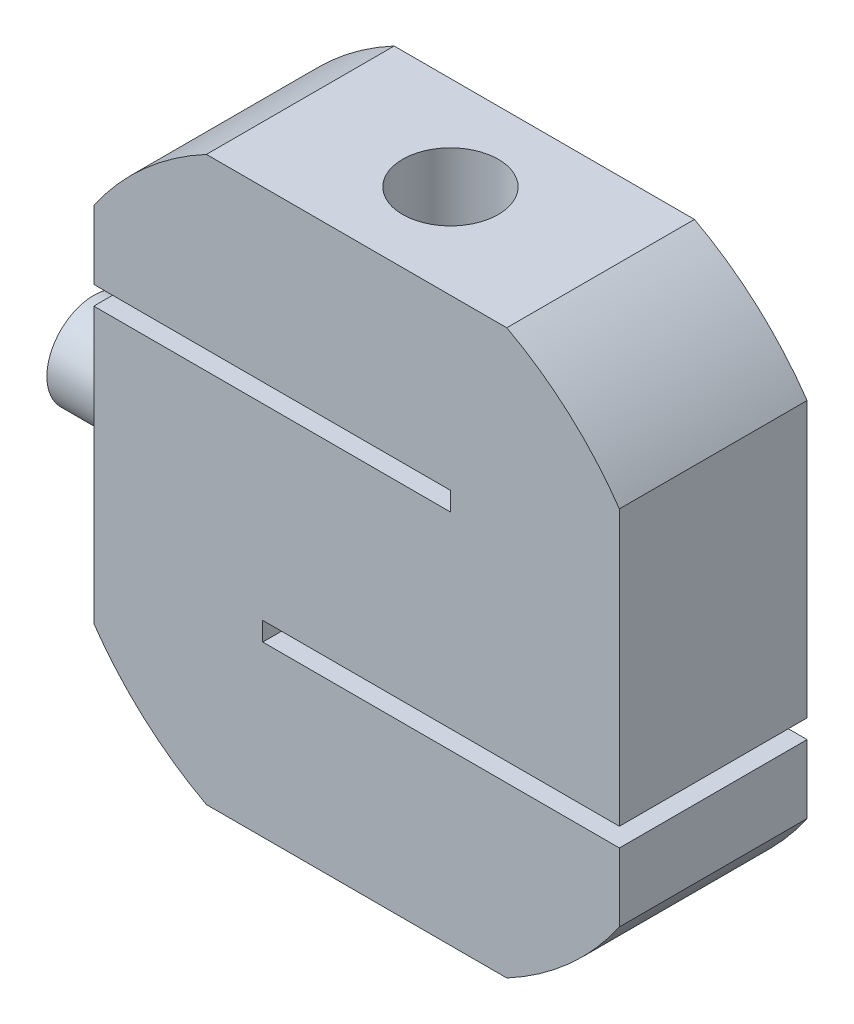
ISO-10303-21;
HEADER;
FILE_DESCRIPTION(('STEP AP214'),'2;1');
FILE_NAME('part.step','',(''),(''),'','','');
FILE_SCHEMA(('AUTOMOTIVE_DESIGN { 1 0 10303 214 1 1 1 1 }'));
ENDSEC;
DATA;
#1=APPLICATION_CONTEXT('core data for automotive mechanical design processes');
#2=APPLICATION_PROTOCOL_DEFINITION('international standard','automotive_design',2000,#1);
#3=PRODUCT_CONTEXT('',#1,'mechanical');
#4=PRODUCT('Part','Part','',(#3));
#5=PRODUCT_RELATED_PRODUCT_CATEGORY('part','',(#4));
#6=PRODUCT_DEFINITION_FORMATION('','',#4);
#7=PRODUCT_DEFINITION_CONTEXT('part definition',#1,'design');
#8=PRODUCT_DEFINITION('design','',#6,#7);
#9=PRODUCT_DEFINITION_SHAPE('','',#8);
#10=(LENGTH_UNIT() NAMED_UNIT(*) SI_UNIT(.MILLI.,.METRE.));
#11=(NAMED_UNIT(*) PLANE_ANGLE_UNIT() SI_UNIT($,.RADIAN.));
#12=(NAMED_UNIT(*) SI_UNIT($,.STERADIAN.) SOLID_ANGLE_UNIT());
#13=UNCERTAINTY_MEASURE_WITH_UNIT(LENGTH_MEASURE(1.E-05),#10,'distance_accuracy_value','');
#14=(GEOMETRIC_REPRESENTATION_CONTEXT(3) GLOBAL_UNCERTAINTY_ASSIGNED_CONTEXT((#13)) GLOBAL_UNIT_ASSIGNED_CONTEXT((#10,
#11,#12)) REPRESENTATION_CONTEXT('',''));
#15=CARTESIAN_POINT('',(0.,0.,0.));
#16=DIRECTION('',(0.,0.,1.));
#17=DIRECTION('',(1.,0.,0.));
#18=AXIS2_PLACEMENT_3D('',#15,#16,#17);
#19=CARTESIAN_POINT('',(-34.,-30.,4.));
#20=DIRECTION('',(-1.,0.,0.));
#21=DIRECTION('',(0.,-1.,0.));
#22=AXIS2_PLACEMENT_3D('',#19,#20,#21);
#23=PLANE('',#22);
#24=CARTESIAN_POINT('',(-34.,-30.,4.));
#25=DIRECTION('',(1.,0.,0.));
#26=DIRECTION('',(0.,1.,0.));
#27=AXIS2_PLACEMENT_3D('',#24,#25,#26);
#28=CIRCLE('',#27,5.);
#29=CARTESIAN_POINT('',(-34.,-25.,4.));
#30=VERTEX_POINT('',#29);
#31=EDGE_CURVE('P0_E17',#30,#30,#28,.T.);
#32=ORIENTED_EDGE('',*,*,#31,.F.);
#33=EDGE_LOOP('',(#32));
#34=FACE_BOUND('',#33,.T.);
#35=ADVANCED_FACE('P0_F14',(#34),#23,.T.);
#36=CARTESIAN_POINT('',(-28.,-30.,4.));
#37=DIRECTION('',(-1.,0.,0.));
#38=DIRECTION('',(0.,-1.,0.));
#39=AXIS2_PLACEMENT_3D('',#36,#37,#38);
#40=PLANE('',#39);
#41=CARTESIAN_POINT('',(-28.,-30.,4.));
#42=DIRECTION('',(1.,0.,0.));
#43=DIRECTION('',(0.,1.,0.));
#44=AXIS2_PLACEMENT_3D('',#41,#42,#43);
#45=CIRCLE('',#44,5.);
#46=CARTESIAN_POINT('',(-28.,-25.,4.));
#47=VERTEX_POINT('',#46);
#48=EDGE_CURVE('P0_E10',#47,#47,#45,.F.);
#49=ORIENTED_EDGE('',*,*,#48,.F.);
#50=EDGE_LOOP('',(#49));
#51=FACE_BOUND('',#50,.T.);
#52=ADVANCED_FACE('P0_F29',(#51),#40,.F.);
#53=CARTESIAN_POINT('',(-34.,-30.,4.));
#54=DIRECTION('',(1.,0.,0.));
#55=DIRECTION('',(0.,1.,0.));
#56=AXIS2_PLACEMENT_3D('',#53,#54,#55);
#57=CYLINDRICAL_SURFACE('',#56,5.);
#58=ORIENTED_EDGE('',*,*,#31,.T.);
#59=EDGE_LOOP('',(#58));
#60=FACE_BOUND('',#59,.T.);
#61=ORIENTED_EDGE('',*,*,#48,.T.);
#62=EDGE_LOOP('',(#61));
#63=FACE_BOUND('',#62,.T.);
#64=ADVANCED_FACE('P0_F26',(#60,#63),#57,.T.);
#65=CLOSED_SHELL('',(#35,#52,#64));
#66=MANIFOLD_SOLID_BREP('P0_B1',#65);
#67=CARTESIAN_POINT('',(0.,0.,0.));
#68=DIRECTION('',(0.,1.,0.));
#69=DIRECTION('',(0.,0.,1.));
#70=AXIS2_PLACEMENT_3D('',#67,#68,#69);
#71=CYLINDRICAL_SURFACE('',#70,5.1);
#72=CARTESIAN_POINT('',(0.,-18.,0.));
#73=DIRECTION('',(0.,1.,0.));
#74=DIRECTION('',(0.,0.,1.));
#75=AXIS2_PLACEMENT_3D('',#72,#73,#74);
#76=CIRCLE('',#75,5.1);
#77=CARTESIAN_POINT('',(0.,-18.,5.1));
#78=VERTEX_POINT('',#77);
#79=EDGE_CURVE('P1_E252',#78,#78,#76,.F.);
#80=ORIENTED_EDGE('',*,*,#79,.T.);
#81=EDGE_LOOP('',(#80));
#82=FACE_BOUND('',#81,.T.);
#83=CARTESIAN_POINT('',(0.,0.,0.));
#84=DIRECTION('',(0.,1.,0.));
#85=DIRECTION('',(0.,0.,1.));
#86=AXIS2_PLACEMENT_3D('',#83,#84,#85);
#87=CIRCLE('',#86,5.1);
#88=CARTESIAN_POINT('',(0.,0.,5.1));
#89=VERTEX_POINT('',#88);
#90=EDGE_CURVE('P1_E140',#89,#89,#87,.T.);
#91=ORIENTED_EDGE('',*,*,#90,.T.);
#92=EDGE_LOOP('',(#91));
#93=FACE_BOUND('',#92,.T.);
#94=ADVANCED_FACE('P1_F16',(#82,#93),#71,.F.);
#95=CARTESIAN_POINT('',(0.,-60.,0.));
#96=DIRECTION('',(0.,-1.,0.));
#97=DIRECTION('',(0.,0.,-1.));
#98=AXIS2_PLACEMENT_3D('',#95,#96,#97);
#99=CYLINDRICAL_SURFACE('',#98,5.09999999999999);
#100=CARTESIAN_POINT('',(0.,-42.,0.));
#101=DIRECTION('',(0.,-1.,0.));
#102=DIRECTION('',(0.,0.,-1.));
#103=AXIS2_PLACEMENT_3D('',#100,#101,#102);
#104=CIRCLE('',#103,5.09999999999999);
#105=CARTESIAN_POINT('',(0.,-42.,-5.09999999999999));
#106=VERTEX_POINT('',#105);
#107=EDGE_CURVE('P1_E238',#106,#106,#104,.F.);
#108=ORIENTED_EDGE('',*,*,#107,.T.);
#109=EDGE_LOOP('',(#108));
#110=FACE_BOUND('',#109,.T.);
#111=CARTESIAN_POINT('',(0.,-60.,0.));
#112=DIRECTION('',(0.,-1.,0.));
#113=DIRECTION('',(0.,0.,-1.));
#114=AXIS2_PLACEMENT_3D('',#111,#112,#113);
#115=CIRCLE('',#114,5.09999999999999);
#116=CARTESIAN_POINT('',(0.,-60.,-5.09999999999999));
#117=VERTEX_POINT('',#116);
#118=EDGE_CURVE('P1_E189',#117,#117,#115,.T.);
#119=ORIENTED_EDGE('',*,*,#118,.T.);
#120=EDGE_LOOP('',(#119));
#121=FACE_BOUND('',#120,.T.);
#122=ADVANCED_FACE('P1_F422',(#110,#121),#99,.F.);
#123=CARTESIAN_POINT('',(0.,0.,0.));
#124=DIRECTION('',(0.,1.,0.));
#125=DIRECTION('',(0.,0.,1.));
#126=AXIS2_PLACEMENT_3D('',#123,#124,#125);
#127=CYLINDRICAL_SURFACE('',#126,5.1);
#128=CARTESIAN_POINT('',(0.,-40.,0.));
#129=DIRECTION('',(0.,1.,0.));
#130=DIRECTION('',(0.,0.,1.));
#131=AXIS2_PLACEMENT_3D('',#128,#129,#130);
#132=CIRCLE('',#131,5.1);
#133=CARTESIAN_POINT('',(0.,-40.,5.1));
#134=VERTEX_POINT('',#133);
#135=EDGE_CURVE('P1_E234',#134,#134,#132,.F.);
#136=ORIENTED_EDGE('',*,*,#135,.T.);
#137=EDGE_LOOP('',(#136));
#138=FACE_BOUND('',#137,.T.);
#139=CARTESIAN_POINT('',(0.,-20.,0.));
#140=DIRECTION('',(0.,1.,0.));
#141=DIRECTION('',(0.,0.,1.));
#142=AXIS2_PLACEMENT_3D('',#139,#140,#141);
#143=CIRCLE('',#142,5.1);
#144=CARTESIAN_POINT('',(0.,-20.,5.1));
#145=VERTEX_POINT('',#144);
#146=EDGE_CURVE('P1_E204',#145,#145,#143,.T.);
#147=ORIENTED_EDGE('',*,*,#146,.T.);
#148=EDGE_LOOP('',(#147));
#149=FACE_BOUND('',#148,.T.);
#150=ADVANCED_FACE('P1_F418',(#138,#149),#127,.F.);
#151=CARTESIAN_POINT('',(-28.,-18.,-10.));
#152=DIRECTION('',(0.,0.,1.));
#153=DIRECTION('',(1.,0.,0.));
#154=AXIS2_PLACEMENT_3D('',#151,#152,#153);
#155=PLANE('',#154);
#156=DIRECTION('',(0.,-1.,0.));
#157=VECTOR('',#156,1.);
#158=CARTESIAN_POINT('',(28.,0.,-10.));
#159=LINE('',#158,#157);
#160=CARTESIAN_POINT('',(28.,-10.7126984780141,-10.));
#161=VERTEX_POINT('',#160);
#162=CARTESIAN_POINT('',(28.,-40.,-10.));
#163=VERTEX_POINT('',#162);
#164=EDGE_CURVE('P1_E125',#161,#163,#159,.T.);
#165=ORIENTED_EDGE('',*,*,#164,.T.);
#166=DIRECTION('',(1.,0.,0.));
#167=VECTOR('',#166,1.);
#168=CARTESIAN_POINT('',(28.,-40.,-10.));
#169=LINE('',#168,#167);
#170=CARTESIAN_POINT('',(-9.99999999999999,-40.,-10.));
#171=VERTEX_POINT('',#170);
#172=EDGE_CURVE('P1_E160',#163,#171,#169,.F.);
#173=ORIENTED_EDGE('',*,*,#172,.T.);
#174=DIRECTION('',(0.,1.,0.));
#175=VECTOR('',#174,1.);
#176=CARTESIAN_POINT('',(-9.99999999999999,-40.,-10.));
#177=LINE('',#176,#175);
#178=CARTESIAN_POINT('',(-9.99999999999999,-42.,-10.));
#179=VERTEX_POINT('',#178);
#180=EDGE_CURVE('P1_E237',#171,#179,#177,.F.);
#181=ORIENTED_EDGE('',*,*,#180,.T.);
#182=DIRECTION('',(1.,0.,0.));
#183=VECTOR('',#182,1.);
#184=CARTESIAN_POINT('',(-9.99999999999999,-42.,-10.));
#185=LINE('',#184,#183);
#186=CARTESIAN_POINT('',(28.,-42.,-10.));
#187=VERTEX_POINT('',#186);
#188=EDGE_CURVE('P1_E179',#179,#187,#185,.T.);
#189=ORIENTED_EDGE('',*,*,#188,.T.);
#190=DIRECTION('',(0.,-1.,0.));
#191=VECTOR('',#190,1.);
#192=CARTESIAN_POINT('',(28.,-42.,-10.));
#193=LINE('',#192,#191);
#194=CARTESIAN_POINT('',(28.,-49.2873015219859,-10.));
#195=VERTEX_POINT('',#194);
#196=EDGE_CURVE('P1_E173',#187,#195,#193,.T.);
#197=ORIENTED_EDGE('',*,*,#196,.T.);
#198=CARTESIAN_POINT('',(0.,-30.,-10.));
#199=DIRECTION('',(0.,0.,1.));
#200=DIRECTION('',(1.,0.,0.));
#201=AXIS2_PLACEMENT_3D('',#198,#199,#200);
#202=CIRCLE('',#201,34.);
#203=CARTESIAN_POINT('',(16.,-60.,-10.));
#204=VERTEX_POINT('',#203);
#205=EDGE_CURVE('P1_E176',#204,#195,#202,.T.);
#206=ORIENTED_EDGE('',*,*,#205,.F.);
#207=DIRECTION('',(-1.,0.,0.));
#208=VECTOR('',#207,1.);
#209=CARTESIAN_POINT('',(-28.,-60.,-10.));
#210=LINE('',#209,#208);
#211=CARTESIAN_POINT('',(-16.,-60.,-10.));
#212=VERTEX_POINT('',#211);
#213=EDGE_CURVE('P1_E186',#204,#212,#210,.T.);
#214=ORIENTED_EDGE('',*,*,#213,.T.);
#215=CARTESIAN_POINT('',(0.,-30.,-10.));
#216=DIRECTION('',(0.,0.,1.));
#217=DIRECTION('',(1.,0.,0.));
#218=AXIS2_PLACEMENT_3D('',#215,#216,#217);
#219=CIRCLE('',#218,34.);
#220=CARTESIAN_POINT('',(-28.,-49.2873015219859,-10.));
#221=VERTEX_POINT('',#220);
#222=EDGE_CURVE('P1_E246',#221,#212,#219,.T.);
#223=ORIENTED_EDGE('',*,*,#222,.F.);
#224=DIRECTION('',(0.,1.,0.));
#225=VECTOR('',#224,1.);
#226=CARTESIAN_POINT('',(-28.,-20.,-10.));
#227=LINE('',#226,#225);
#228=CARTESIAN_POINT('',(-28.,-20.,-10.));
#229=VERTEX_POINT('',#228);
#230=EDGE_CURVE('P1_E190',#221,#229,#227,.T.);
#231=ORIENTED_EDGE('',*,*,#230,.T.);
#232=DIRECTION('',(1.,0.,0.));
#233=VECTOR('',#232,1.);
#234=CARTESIAN_POINT('',(10.,-20.,-10.));
#235=LINE('',#234,#233);
#236=CARTESIAN_POINT('',(10.,-20.,-10.));
#237=VERTEX_POINT('',#236);
#238=EDGE_CURVE('P1_E193',#229,#237,#235,.T.);
#239=ORIENTED_EDGE('',*,*,#238,.T.);
#240=DIRECTION('',(0.,1.,0.));
#241=VECTOR('',#240,1.);
#242=CARTESIAN_POINT('',(10.,-18.,-10.));
#243=LINE('',#242,#241);
#244=CARTESIAN_POINT('',(10.,-18.,-10.));
#245=VERTEX_POINT('',#244);
#246=EDGE_CURVE('P1_E201',#237,#245,#243,.T.);
#247=ORIENTED_EDGE('',*,*,#246,.T.);
#248=DIRECTION('',(1.,0.,0.));
#249=VECTOR('',#248,1.);
#250=CARTESIAN_POINT('',(-28.,-18.,-10.));
#251=LINE('',#250,#249);
#252=CARTESIAN_POINT('',(-28.,-18.,-10.));
#253=VERTEX_POINT('',#252);
#254=EDGE_CURVE('P1_E208',#245,#253,#251,.F.);
#255=ORIENTED_EDGE('',*,*,#254,.T.);
#256=DIRECTION('',(0.,1.,0.));
#257=VECTOR('',#256,1.);
#258=CARTESIAN_POINT('',(-28.,0.,-10.));
#259=LINE('',#258,#257);
#260=CARTESIAN_POINT('',(-28.,-10.7126984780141,-10.));
#261=VERTEX_POINT('',#260);
#262=EDGE_CURVE('P1_E214',#253,#261,#259,.T.);
#263=ORIENTED_EDGE('',*,*,#262,.T.);
#264=CARTESIAN_POINT('',(0.,-30.,-10.));
#265=DIRECTION('',(0.,0.,1.));
#266=DIRECTION('',(1.,0.,0.));
#267=AXIS2_PLACEMENT_3D('',#264,#265,#266);
#268=CIRCLE('',#267,34.);
#269=CARTESIAN_POINT('',(-16.,0.,-10.));
#270=VERTEX_POINT('',#269);
#271=EDGE_CURVE('P1_E135',#270,#261,#268,.T.);
#272=ORIENTED_EDGE('',*,*,#271,.F.);
#273=DIRECTION('',(1.,0.,0.));
#274=VECTOR('',#273,1.);
#275=CARTESIAN_POINT('',(-28.,0.,-10.));
#276=LINE('',#275,#274);
#277=CARTESIAN_POINT('',(16.,0.,-10.));
#278=VERTEX_POINT('',#277);
#279=EDGE_CURVE('P1_E130',#270,#278,#276,.T.);
#280=ORIENTED_EDGE('',*,*,#279,.T.);
#281=CARTESIAN_POINT('',(0.,-30.,-10.));
#282=DIRECTION('',(0.,0.,1.));
#283=DIRECTION('',(1.,0.,0.));
#284=AXIS2_PLACEMENT_3D('',#281,#282,#283);
#285=CIRCLE('',#284,34.);
#286=EDGE_CURVE('P1_E19',#161,#278,#285,.T.);
#287=ORIENTED_EDGE('',*,*,#286,.F.);
#288=EDGE_LOOP('',(#165,#173,#181,#189,#197,#206,#214,#223,#231,#239,#247,#255,#263,#272,#280,#287));
#289=FACE_BOUND('',#288,.T.);
#290=ADVANCED_FACE('P1_F132',(#289),#155,.F.);
#291=CARTESIAN_POINT('',(28.,0.,10.));
#292=DIRECTION('',(-1.,0.,0.));
#293=DIRECTION('',(0.,-1.,0.));
#294=AXIS2_PLACEMENT_3D('',#291,#292,#293);
#295=PLANE('',#294);
#296=DIRECTION('',(0.,1.,0.));
#297=VECTOR('',#296,1.);
#298=CARTESIAN_POINT('',(28.,-18.,10.));
#299=LINE('',#298,#297);
#300=CARTESIAN_POINT('',(28.,-40.,10.));
#301=VERTEX_POINT('',#300);
#302=CARTESIAN_POINT('',(28.,-10.7126984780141,10.));
#303=VERTEX_POINT('',#302);
#304=EDGE_CURVE('P1_E170',#301,#303,#299,.T.);
#305=ORIENTED_EDGE('',*,*,#304,.F.);
#306=DIRECTION('',(0.,0.,1.));
#307=VECTOR('',#306,1.);
#308=CARTESIAN_POINT('',(28.,-40.,10.));
#309=LINE('',#308,#307);
#310=EDGE_CURVE('P1_E158',#301,#163,#309,.F.);
#311=ORIENTED_EDGE('',*,*,#310,.T.);
#312=ORIENTED_EDGE('',*,*,#164,.F.);
#313=DIRECTION('',(0.,0.,1.));
#314=VECTOR('',#313,1.);
#315=CARTESIAN_POINT('',(28.,-10.7126984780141,-15.));
#316=LINE('',#315,#314);
#317=EDGE_CURVE('P1_E146',#303,#161,#316,.F.);
#318=ORIENTED_EDGE('',*,*,#317,.F.);
#319=EDGE_LOOP('',(#305,#311,#312,#318));
#320=FACE_BOUND('',#319,.T.);
#321=ADVANCED_FACE('P1_F269',(#320),#295,.F.);
#322=CARTESIAN_POINT('',(0.,-30.,-15.));
#323=DIRECTION('',(0.,0.,1.));
#324=DIRECTION('',(1.,0.,0.));
#325=AXIS2_PLACEMENT_3D('',#322,#323,#324);
#326=CYLINDRICAL_SURFACE('',#325,34.);
#327=DIRECTION('',(0.,0.,1.));
#328=VECTOR('',#327,1.);
#329=CARTESIAN_POINT('',(16.,0.,10.));
#330=LINE('',#329,#328);
#331=CARTESIAN_POINT('',(16.,0.,10.));
#332=VERTEX_POINT('',#331);
#333=EDGE_CURVE('P1_E139',#278,#332,#330,.T.);
#334=ORIENTED_EDGE('',*,*,#333,.T.);
#335=CARTESIAN_POINT('',(0.,-30.,10.));
#336=DIRECTION('',(0.,0.,1.));
#337=DIRECTION('',(1.,0.,0.));
#338=AXIS2_PLACEMENT_3D('',#335,#336,#337);
#339=CIRCLE('',#338,34.);
#340=EDGE_CURVE('P1_E232',#303,#332,#339,.T.);
#341=ORIENTED_EDGE('',*,*,#340,.F.);
#342=ORIENTED_EDGE('',*,*,#317,.T.);
#343=ORIENTED_EDGE('',*,*,#286,.T.);
#344=EDGE_LOOP('',(#334,#341,#342,#343));
#345=FACE_BOUND('',#344,.T.);
#346=ADVANCED_FACE('P1_F143',(#345),#326,.T.);
#347=CARTESIAN_POINT('',(-28.,0.,10.));
#348=DIRECTION('',(0.,-1.,0.));
#349=DIRECTION('',(1.,0.,0.));
#350=AXIS2_PLACEMENT_3D('',#347,#348,#349);
#351=PLANE('',#350);
#352=ORIENTED_EDGE('',*,*,#279,.F.);
#353=DIRECTION('',(0.,0.,1.));
#354=VECTOR('',#353,1.);
#355=CARTESIAN_POINT('',(-16.,0.,-15.));
#356=LINE('',#355,#354);
#357=CARTESIAN_POINT('',(-16.,0.,10.));
#358=VERTEX_POINT('',#357);
#359=EDGE_CURVE('P1_E152',#358,#270,#356,.F.);
#360=ORIENTED_EDGE('',*,*,#359,.F.);
#361=DIRECTION('',(1.,0.,0.));
#362=VECTOR('',#361,1.);
#363=CARTESIAN_POINT('',(-28.,0.,10.));
#364=LINE('',#363,#362);
#365=EDGE_CURVE('P1_E150',#332,#358,#364,.F.);
#366=ORIENTED_EDGE('',*,*,#365,.F.);
#367=ORIENTED_EDGE('',*,*,#333,.F.);
#368=EDGE_LOOP('',(#352,#360,#366,#367));
#369=FACE_BOUND('',#368,.T.);
#370=ORIENTED_EDGE('',*,*,#90,.F.);
#371=EDGE_LOOP('',(#370));
#372=FACE_BOUND('',#371,.T.);
#373=ADVANCED_FACE('P1_F147',(#369,#372),#351,.F.);
#374=CARTESIAN_POINT('',(0.,-30.,-15.));
#375=DIRECTION('',(0.,0.,1.));
#376=DIRECTION('',(1.,0.,0.));
#377=AXIS2_PLACEMENT_3D('',#374,#375,#376);
#378=CYLINDRICAL_SURFACE('',#377,34.);
#379=DIRECTION('',(0.,0.,1.));
#380=VECTOR('',#379,1.);
#381=CARTESIAN_POINT('',(-28.,-10.7126984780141,10.));
#382=LINE('',#381,#380);
#383=CARTESIAN_POINT('',(-28.,-10.7126984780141,10.));
#384=VERTEX_POINT('',#383);
#385=EDGE_CURVE('P1_E216',#261,#384,#382,.T.);
#386=ORIENTED_EDGE('',*,*,#385,.T.);
#387=CARTESIAN_POINT('',(0.,-30.,10.));
#388=DIRECTION('',(0.,0.,1.));
#389=DIRECTION('',(1.,0.,0.));
#390=AXIS2_PLACEMENT_3D('',#387,#388,#389);
#391=CIRCLE('',#390,34.);
#392=EDGE_CURVE('P1_E228',#358,#384,#391,.T.);
#393=ORIENTED_EDGE('',*,*,#392,.F.);
#394=ORIENTED_EDGE('',*,*,#359,.T.);
#395=ORIENTED_EDGE('',*,*,#271,.T.);
#396=EDGE_LOOP('',(#386,#393,#394,#395));
#397=FACE_BOUND('',#396,.T.);
#398=ADVANCED_FACE('P1_F259',(#397),#378,.T.);
#399=CARTESIAN_POINT('',(-28.,0.,10.));
#400=DIRECTION('',(1.,0.,0.));
#401=DIRECTION('',(0.,1.,0.));
#402=AXIS2_PLACEMENT_3D('',#399,#400,#401);
#403=PLANE('',#402);
#404=ORIENTED_EDGE('',*,*,#262,.F.);
#405=DIRECTION('',(0.,0.,1.));
#406=VECTOR('',#405,1.);
#407=CARTESIAN_POINT('',(-28.,-18.,10.));
#408=LINE('',#407,#406);
#409=CARTESIAN_POINT('',(-28.,-18.,10.));
#410=VERTEX_POINT('',#409);
#411=EDGE_CURVE('P1_E211',#253,#410,#408,.T.);
#412=ORIENTED_EDGE('',*,*,#411,.T.);
#413=DIRECTION('',(0.,1.,0.));
#414=VECTOR('',#413,1.);
#415=CARTESIAN_POINT('',(-28.,-18.,10.));
#416=LINE('',#415,#414);
#417=EDGE_CURVE('P1_E231',#384,#410,#416,.F.);
#418=ORIENTED_EDGE('',*,*,#417,.F.);
#419=ORIENTED_EDGE('',*,*,#385,.F.);
#420=EDGE_LOOP('',(#404,#412,#418,#419));
#421=FACE_BOUND('',#420,.T.);
#422=ADVANCED_FACE('P1_F266',(#421),#403,.F.);
#423=CARTESIAN_POINT('',(-28.,-18.,10.));
#424=DIRECTION('',(0.,1.,0.));
#425=DIRECTION('',(0.,0.,1.));
#426=AXIS2_PLACEMENT_3D('',#423,#424,#425);
#427=PLANE('',#426);
#428=DIRECTION('',(0.,0.,1.));
#429=VECTOR('',#428,1.);
#430=CARTESIAN_POINT('',(10.,-18.,10.));
#431=LINE('',#430,#429);
#432=CARTESIAN_POINT('',(10.,-18.,10.));
#433=VERTEX_POINT('',#432);
#434=EDGE_CURVE('P1_E205',#245,#433,#431,.T.);
#435=ORIENTED_EDGE('',*,*,#434,.T.);
#436=DIRECTION('',(1.,0.,0.));
#437=VECTOR('',#436,1.);
#438=CARTESIAN_POINT('',(-28.,-18.,10.));
#439=LINE('',#438,#437);
#440=EDGE_CURVE('P1_E333',#410,#433,#439,.T.);
#441=ORIENTED_EDGE('',*,*,#440,.F.);
#442=ORIENTED_EDGE('',*,*,#411,.F.);
#443=ORIENTED_EDGE('',*,*,#254,.F.);
#444=EDGE_LOOP('',(#435,#441,#442,#443));
#445=FACE_BOUND('',#444,.T.);
#446=ORIENTED_EDGE('',*,*,#79,.F.);
#447=EDGE_LOOP('',(#446));
#448=FACE_BOUND('',#447,.T.);
#449=ADVANCED_FACE('P1_F317',(#445,#448),#427,.F.);
#450=CARTESIAN_POINT('',(10.,-18.,10.));
#451=DIRECTION('',(1.,0.,0.));
#452=DIRECTION('',(0.,1.,0.));
#453=AXIS2_PLACEMENT_3D('',#450,#451,#452);
#454=PLANE('',#453);
#455=DIRECTION('',(0.,0.,1.));
#456=VECTOR('',#455,1.);
#457=CARTESIAN_POINT('',(10.,-20.,10.));
#458=LINE('',#457,#456);
#459=CARTESIAN_POINT('',(10.,-20.,10.));
#460=VERTEX_POINT('',#459);
#461=EDGE_CURVE('P1_E198',#237,#460,#458,.T.);
#462=ORIENTED_EDGE('',*,*,#461,.T.);
#463=DIRECTION('',(0.,1.,0.));
#464=VECTOR('',#463,1.);
#465=CARTESIAN_POINT('',(10.,-18.,10.));
#466=LINE('',#465,#464);
#467=EDGE_CURVE('P1_E375',#433,#460,#466,.F.);
#468=ORIENTED_EDGE('',*,*,#467,.F.);
#469=ORIENTED_EDGE('',*,*,#434,.F.);
#470=ORIENTED_EDGE('',*,*,#246,.F.);
#471=EDGE_LOOP('',(#462,#468,#469,#470));
#472=FACE_BOUND('',#471,.T.);
#473=ADVANCED_FACE('P1_F313',(#472),#454,.F.);
#474=CARTESIAN_POINT('',(10.,-20.,10.));
#475=DIRECTION('',(0.,-1.,0.));
#476=DIRECTION('',(1.,0.,0.));
#477=AXIS2_PLACEMENT_3D('',#474,#475,#476);
#478=PLANE('',#477);
#479=DIRECTION('',(0.,0.,1.));
#480=VECTOR('',#479,1.);
#481=CARTESIAN_POINT('',(-28.,-20.,10.));
#482=LINE('',#481,#480);
#483=CARTESIAN_POINT('',(-28.,-20.,10.));
#484=VERTEX_POINT('',#483);
#485=EDGE_CURVE('P1_E192',#229,#484,#482,.T.);
#486=ORIENTED_EDGE('',*,*,#485,.T.);
#487=DIRECTION('',(1.,0.,0.));
#488=VECTOR('',#487,1.);
#489=CARTESIAN_POINT('',(-28.,-20.,10.));
#490=LINE('',#489,#488);
#491=EDGE_CURVE('P1_E372',#460,#484,#490,.F.);
#492=ORIENTED_EDGE('',*,*,#491,.F.);
#493=ORIENTED_EDGE('',*,*,#461,.F.);
#494=ORIENTED_EDGE('',*,*,#238,.F.);
#495=EDGE_LOOP('',(#486,#492,#493,#494));
#496=FACE_BOUND('',#495,.T.);
#497=ORIENTED_EDGE('',*,*,#146,.F.);
#498=EDGE_LOOP('',(#497));
#499=FACE_BOUND('',#498,.T.);
#500=ADVANCED_FACE('P1_F309',(#496,#499),#478,.F.);
#501=CARTESIAN_POINT('',(-28.,-20.,10.));
#502=DIRECTION('',(1.,0.,0.));
#503=DIRECTION('',(0.,1.,0.));
#504=AXIS2_PLACEMENT_3D('',#501,#502,#503);
#505=PLANE('',#504);
#506=DIRECTION('',(0.,1.,0.));
#507=VECTOR('',#506,1.);
#508=CARTESIAN_POINT('',(-28.,-18.,10.));
#509=LINE('',#508,#507);
#510=CARTESIAN_POINT('',(-28.,-49.2873015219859,10.));
#511=VERTEX_POINT('',#510);
#512=EDGE_CURVE('P1_E227',#484,#511,#509,.F.);
#513=ORIENTED_EDGE('',*,*,#512,.F.);
#514=ORIENTED_EDGE('',*,*,#485,.F.);
#515=ORIENTED_EDGE('',*,*,#230,.F.);
#516=DIRECTION('',(0.,0.,1.));
#517=VECTOR('',#516,1.);
#518=CARTESIAN_POINT('',(-28.,-49.2873015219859,-15.));
#519=LINE('',#518,#517);
#520=EDGE_CURVE('P1_E249',#511,#221,#519,.F.);
#521=ORIENTED_EDGE('',*,*,#520,.F.);
#522=EDGE_LOOP('',(#513,#514,#515,#521));
#523=FACE_BOUND('',#522,.T.);
#524=ADVANCED_FACE('P1_F305',(#523),#505,.F.);
#525=CARTESIAN_POINT('',(0.,-30.,-15.));
#526=DIRECTION('',(0.,0.,1.));
#527=DIRECTION('',(1.,0.,0.));
#528=AXIS2_PLACEMENT_3D('',#525,#526,#527);
#529=CYLINDRICAL_SURFACE('',#528,34.);
#530=DIRECTION('',(0.,0.,1.));
#531=VECTOR('',#530,1.);
#532=CARTESIAN_POINT('',(-16.,-60.,10.));
#533=LINE('',#532,#531);
#534=CARTESIAN_POINT('',(-16.,-60.,10.));
#535=VERTEX_POINT('',#534);
#536=EDGE_CURVE('P1_E188',#212,#535,#533,.T.);
#537=ORIENTED_EDGE('',*,*,#536,.T.);
#538=CARTESIAN_POINT('',(0.,-30.,10.));
#539=DIRECTION('',(0.,0.,1.));
#540=DIRECTION('',(1.,0.,0.));
#541=AXIS2_PLACEMENT_3D('',#538,#539,#540);
#542=CIRCLE('',#541,34.);
#543=EDGE_CURVE('P1_E224',#511,#535,#542,.T.);
#544=ORIENTED_EDGE('',*,*,#543,.F.);
#545=ORIENTED_EDGE('',*,*,#520,.T.);
#546=ORIENTED_EDGE('',*,*,#222,.T.);
#547=EDGE_LOOP('',(#537,#544,#545,#546));
#548=FACE_BOUND('',#547,.T.);
#549=ADVANCED_FACE('P1_F301',(#548),#529,.T.);
#550=CARTESIAN_POINT('',(-28.,-60.,10.));
#551=DIRECTION('',(0.,1.,0.));
#552=DIRECTION('',(-1.,0.,0.));
#553=AXIS2_PLACEMENT_3D('',#550,#551,#552);
#554=PLANE('',#553);
#555=ORIENTED_EDGE('',*,*,#213,.F.);
#556=DIRECTION('',(0.,0.,1.));
#557=VECTOR('',#556,1.);
#558=CARTESIAN_POINT('',(16.,-60.,-15.));
#559=LINE('',#558,#557);
#560=CARTESIAN_POINT('',(16.,-60.,10.));
#561=VERTEX_POINT('',#560);
#562=EDGE_CURVE('P1_E243',#561,#204,#559,.F.);
#563=ORIENTED_EDGE('',*,*,#562,.F.);
#564=DIRECTION('',(1.,0.,0.));
#565=VECTOR('',#564,1.);
#566=CARTESIAN_POINT('',(-28.,-60.,10.));
#567=LINE('',#566,#565);
#568=EDGE_CURVE('P1_E223',#535,#561,#567,.T.);
#569=ORIENTED_EDGE('',*,*,#568,.F.);
#570=ORIENTED_EDGE('',*,*,#536,.F.);
#571=EDGE_LOOP('',(#555,#563,#569,#570));
#572=FACE_BOUND('',#571,.T.);
#573=ORIENTED_EDGE('',*,*,#118,.F.);
#574=EDGE_LOOP('',(#573));
#575=FACE_BOUND('',#574,.T.);
#576=ADVANCED_FACE('P1_F297',(#572,#575),#554,.F.);
#577=CARTESIAN_POINT('',(0.,-30.,-15.));
#578=DIRECTION('',(0.,0.,1.));
#579=DIRECTION('',(1.,0.,0.));
#580=AXIS2_PLACEMENT_3D('',#577,#578,#579);
#581=CYLINDRICAL_SURFACE('',#580,34.);
#582=DIRECTION('',(0.,0.,1.));
#583=VECTOR('',#582,1.);
#584=CARTESIAN_POINT('',(28.,-49.2873015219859,10.));
#585=LINE('',#584,#583);
#586=CARTESIAN_POINT('',(28.,-49.2873015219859,10.));
#587=VERTEX_POINT('',#586);
#588=EDGE_CURVE('P1_E175',#195,#587,#585,.T.);
#589=ORIENTED_EDGE('',*,*,#588,.T.);
#590=CARTESIAN_POINT('',(0.,-30.,10.));
#591=DIRECTION('',(0.,0.,1.));
#592=DIRECTION('',(1.,0.,0.));
#593=AXIS2_PLACEMENT_3D('',#590,#591,#592);
#594=CIRCLE('',#593,34.);
#595=EDGE_CURVE('P1_E219',#561,#587,#594,.T.);
#596=ORIENTED_EDGE('',*,*,#595,.F.);
#597=ORIENTED_EDGE('',*,*,#562,.T.);
#598=ORIENTED_EDGE('',*,*,#205,.T.);
#599=EDGE_LOOP('',(#589,#596,#597,#598));
#600=FACE_BOUND('',#599,.T.);
#601=ADVANCED_FACE('P1_F293',(#600),#581,.T.);
#602=CARTESIAN_POINT('',(28.,-42.,10.));
#603=DIRECTION('',(-1.,0.,0.));
#604=DIRECTION('',(0.,-1.,0.));
#605=AXIS2_PLACEMENT_3D('',#602,#603,#604);
#606=PLANE('',#605);
#607=ORIENTED_EDGE('',*,*,#196,.F.);
#608=DIRECTION('',(0.,0.,-1.));
#609=VECTOR('',#608,1.);
#610=CARTESIAN_POINT('',(28.,-42.,10.));
#611=LINE('',#610,#609);
#612=CARTESIAN_POINT('',(28.,-42.,10.));
#613=VERTEX_POINT('',#612);
#614=EDGE_CURVE('P1_E183',#187,#613,#611,.F.);
#615=ORIENTED_EDGE('',*,*,#614,.T.);
#616=DIRECTION('',(0.,1.,0.));
#617=VECTOR('',#616,1.);
#618=CARTESIAN_POINT('',(28.,-18.,10.));
#619=LINE('',#618,#617);
#620=EDGE_CURVE('P1_E222',#587,#613,#619,.T.);
#621=ORIENTED_EDGE('',*,*,#620,.F.);
#622=ORIENTED_EDGE('',*,*,#588,.F.);
#623=EDGE_LOOP('',(#607,#615,#621,#622));
#624=FACE_BOUND('',#623,.T.);
#625=ADVANCED_FACE('P1_F289',(#624),#606,.F.);
#626=CARTESIAN_POINT('',(-9.99999999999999,-42.,10.));
#627=DIRECTION('',(0.,-1.,0.));
#628=DIRECTION('',(0.,0.,-1.));
#629=AXIS2_PLACEMENT_3D('',#626,#627,#628);
#630=PLANE('',#629);
#631=DIRECTION('',(0.,0.,1.));
#632=VECTOR('',#631,1.);
#633=CARTESIAN_POINT('',(-9.99999999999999,-42.,10.));
#634=LINE('',#633,#632);
#635=CARTESIAN_POINT('',(-9.99999999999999,-42.,10.));
#636=VERTEX_POINT('',#635);
#637=EDGE_CURVE('P1_E182',#179,#636,#634,.T.);
#638=ORIENTED_EDGE('',*,*,#637,.T.);
#639=DIRECTION('',(1.,0.,0.));
#640=VECTOR('',#639,1.);
#641=CARTESIAN_POINT('',(-28.,-42.,10.));
#642=LINE('',#641,#640);
#643=EDGE_CURVE('P1_E356',#613,#636,#642,.F.);
#644=ORIENTED_EDGE('',*,*,#643,.F.);
#645=ORIENTED_EDGE('',*,*,#614,.F.);
#646=ORIENTED_EDGE('',*,*,#188,.F.);
#647=EDGE_LOOP('',(#638,#644,#645,#646));
#648=FACE_BOUND('',#647,.T.);
#649=ORIENTED_EDGE('',*,*,#107,.F.);
#650=EDGE_LOOP('',(#649));
#651=FACE_BOUND('',#650,.T.);
#652=ADVANCED_FACE('P1_F286',(#648,#651),#630,.F.);
#653=CARTESIAN_POINT('',(-9.99999999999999,-40.,10.));
#654=DIRECTION('',(-1.,0.,0.));
#655=DIRECTION('',(0.,0.,1.));
#656=AXIS2_PLACEMENT_3D('',#653,#654,#655);
#657=PLANE('',#656);
#658=DIRECTION('',(0.,0.,1.));
#659=VECTOR('',#658,1.);
#660=CARTESIAN_POINT('',(-9.99999999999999,-40.,10.));
#661=LINE('',#660,#659);
#662=CARTESIAN_POINT('',(-9.99999999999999,-40.,10.));
#663=VERTEX_POINT('',#662);
#664=EDGE_CURVE('P1_E34',#171,#663,#661,.T.);
#665=ORIENTED_EDGE('',*,*,#664,.T.);
#666=DIRECTION('',(0.,1.,0.));
#667=VECTOR('',#666,1.);
#668=CARTESIAN_POINT('',(-9.99999999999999,-18.,10.));
#669=LINE('',#668,#667);
#670=EDGE_CURVE('P1_E25',#636,#663,#669,.T.);
#671=ORIENTED_EDGE('',*,*,#670,.F.);
#672=ORIENTED_EDGE('',*,*,#637,.F.);
#673=ORIENTED_EDGE('',*,*,#180,.F.);
#674=EDGE_LOOP('',(#665,#671,#672,#673));
#675=FACE_BOUND('',#674,.T.);
#676=ADVANCED_FACE('P1_F279',(#675),#657,.F.);
#677=CARTESIAN_POINT('',(28.,-40.,10.));
#678=DIRECTION('',(0.,1.,0.));
#679=DIRECTION('',(0.,0.,1.));
#680=AXIS2_PLACEMENT_3D('',#677,#678,#679);
#681=PLANE('',#680);
#682=ORIENTED_EDGE('',*,*,#310,.F.);
#683=DIRECTION('',(1.,0.,0.));
#684=VECTOR('',#683,1.);
#685=CARTESIAN_POINT('',(-28.,-40.,10.));
#686=LINE('',#685,#684);
#687=EDGE_CURVE('P1_E11',#663,#301,#686,.T.);
#688=ORIENTED_EDGE('',*,*,#687,.F.);
#689=ORIENTED_EDGE('',*,*,#664,.F.);
#690=ORIENTED_EDGE('',*,*,#172,.F.);
#691=EDGE_LOOP('',(#682,#688,#689,#690));
#692=FACE_BOUND('',#691,.T.);
#693=ORIENTED_EDGE('',*,*,#135,.F.);
#694=EDGE_LOOP('',(#693));
#695=FACE_BOUND('',#694,.T.);
#696=ADVANCED_FACE('P1_F273',(#692,#695),#681,.F.);
#697=CARTESIAN_POINT('',(-28.,-18.,10.));
#698=DIRECTION('',(0.,0.,1.));
#699=DIRECTION('',(1.,0.,0.));
#700=AXIS2_PLACEMENT_3D('',#697,#698,#699);
#701=PLANE('',#700);
#702=ORIENTED_EDGE('',*,*,#670,.T.);
#703=ORIENTED_EDGE('',*,*,#687,.T.);
#704=ORIENTED_EDGE('',*,*,#304,.T.);
#705=ORIENTED_EDGE('',*,*,#340,.T.);
#706=ORIENTED_EDGE('',*,*,#365,.T.);
#707=ORIENTED_EDGE('',*,*,#392,.T.);
#708=ORIENTED_EDGE('',*,*,#417,.T.);
#709=ORIENTED_EDGE('',*,*,#440,.T.);
#710=ORIENTED_EDGE('',*,*,#467,.T.);
#711=ORIENTED_EDGE('',*,*,#491,.T.);
#712=ORIENTED_EDGE('',*,*,#512,.T.);
#713=ORIENTED_EDGE('',*,*,#543,.T.);
#714=ORIENTED_EDGE('',*,*,#568,.T.);
#715=ORIENTED_EDGE('',*,*,#595,.T.);
#716=ORIENTED_EDGE('',*,*,#620,.T.);
#717=ORIENTED_EDGE('',*,*,#643,.T.);
#718=EDGE_LOOP('',(#702,#703,#704,#705,#706,#707,#708,#709,#710,#711,#712,#713,#714,#715,#716,#717));
#719=FACE_BOUND('',#718,.T.);
#720=ADVANCED_FACE('P1_F271',(#719),#701,.T.);
#721=CLOSED_SHELL('',(#94,#122,#150,#290,#321,#346,#373,#398,#422,#449,#473,#500,#524,#549,#576,
#601,#625,#652,#676,#696,#720));
#722=MANIFOLD_SOLID_BREP('P1_B1',#721);
#723=ADVANCED_BREP_SHAPE_REPRESENTATION('',(#18,#66,#722),#14);
#724=SHAPE_DEFINITION_REPRESENTATION(#9,#723);
ENDSEC;
END-ISO-10303-21;
